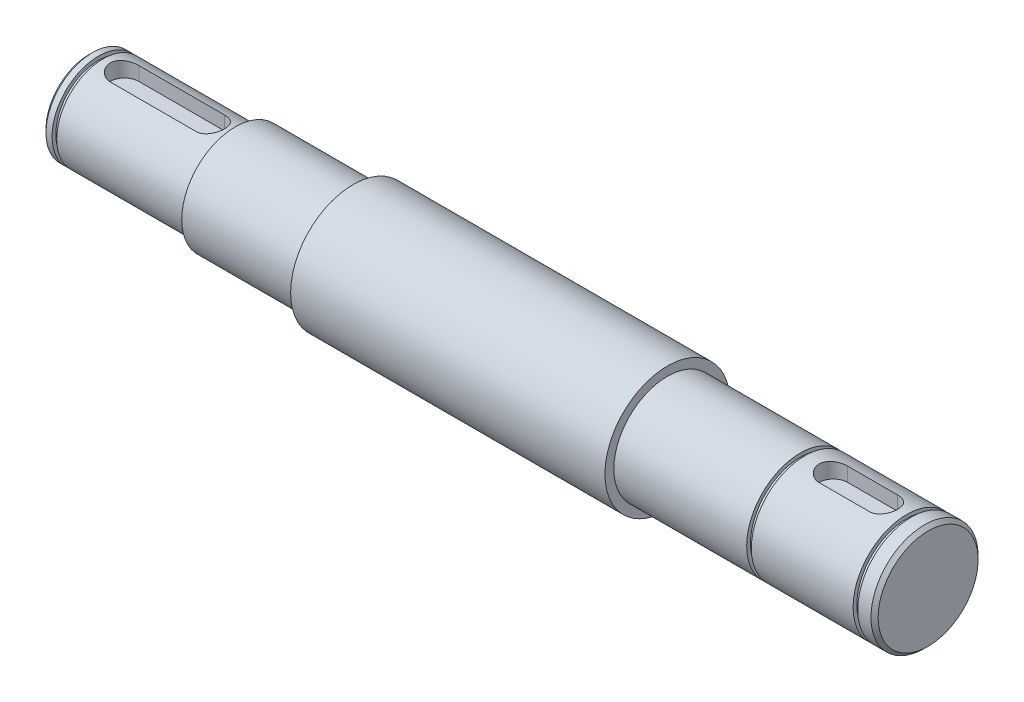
ISO-10303-21;
HEADER;
FILE_DESCRIPTION(('STEP AP214'),'2;1');
FILE_NAME('part.step','',(''),(''),'','','');
FILE_SCHEMA(('AUTOMOTIVE_DESIGN { 1 0 10303 214 1 1 1 1 }'));
ENDSEC;
DATA;
#1=APPLICATION_CONTEXT('core data for automotive mechanical design processes');
#2=APPLICATION_PROTOCOL_DEFINITION('international standard','automotive_design',2000,#1);
#3=PRODUCT_CONTEXT('',#1,'mechanical');
#4=PRODUCT('Part','Part','',(#3));
#5=PRODUCT_RELATED_PRODUCT_CATEGORY('part','',(#4));
#6=PRODUCT_DEFINITION_FORMATION('','',#4);
#7=PRODUCT_DEFINITION_CONTEXT('part definition',#1,'design');
#8=PRODUCT_DEFINITION('design','',#6,#7);
#9=PRODUCT_DEFINITION_SHAPE('','',#8);
#10=(LENGTH_UNIT() NAMED_UNIT(*) SI_UNIT(.MILLI.,.METRE.));
#11=(NAMED_UNIT(*) PLANE_ANGLE_UNIT() SI_UNIT($,.RADIAN.));
#12=(NAMED_UNIT(*) SI_UNIT($,.STERADIAN.) SOLID_ANGLE_UNIT());
#13=UNCERTAINTY_MEASURE_WITH_UNIT(LENGTH_MEASURE(1.E-05),#10,'distance_accuracy_value','');
#14=(GEOMETRIC_REPRESENTATION_CONTEXT(3) GLOBAL_UNCERTAINTY_ASSIGNED_CONTEXT((#13)) GLOBAL_UNIT_ASSIGNED_CONTEXT((#10,
#11,#12)) REPRESENTATION_CONTEXT('',''));
#15=CARTESIAN_POINT('',(0.,0.,0.));
#16=DIRECTION('',(0.,0.,1.));
#17=DIRECTION('',(1.,0.,0.));
#18=AXIS2_PLACEMENT_3D('',#15,#16,#17);
#19=CARTESIAN_POINT('',(0.,0.,0.));
#20=DIRECTION('',(1.,0.,0.));
#21=DIRECTION('',(0.,0.,-1.));
#22=AXIS2_PLACEMENT_3D('',#19,#20,#21);
#23=PLANE('',#22);
#24=CARTESIAN_POINT('',(0.,0.,0.));
#25=DIRECTION('',(1.,0.,0.));
#26=DIRECTION('',(0.,0.,-1.));
#27=AXIS2_PLACEMENT_3D('',#24,#25,#26);
#28=CIRCLE('',#27,12.);
#29=CARTESIAN_POINT('',(0.,0.,-12.));
#30=VERTEX_POINT('',#29);
#31=EDGE_CURVE('E317',#30,#30,#28,.F.);
#32=ORIENTED_EDGE('',*,*,#31,.T.);
#33=EDGE_LOOP('',(#32));
#34=FACE_BOUND('',#33,.T.);
#35=ADVANCED_FACE('F34',(#34),#23,.F.);
#36=CARTESIAN_POINT('',(0.,0.,0.));
#37=DIRECTION('',(-1.,0.,0.));
#38=DIRECTION('',(0.,0.,1.));
#39=AXIS2_PLACEMENT_3D('',#36,#37,#38);
#40=CYLINDRICAL_SURFACE('',#39,13.);
#41=CARTESIAN_POINT('',(1.00000000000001,0.,0.));
#42=DIRECTION('',(1.,0.,0.));
#43=DIRECTION('',(0.,0.,-1.));
#44=AXIS2_PLACEMENT_3D('',#41,#42,#43);
#45=CIRCLE('',#44,13.);
#46=CARTESIAN_POINT('',(1.00000000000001,0.,-13.));
#47=VERTEX_POINT('',#46);
#48=EDGE_CURVE('E315',#47,#47,#45,.T.);
#49=ORIENTED_EDGE('',*,*,#48,.T.);
#50=EDGE_LOOP('',(#49));
#51=FACE_BOUND('',#50,.T.);
#52=CARTESIAN_POINT('',(2.7,0.,0.));
#53=DIRECTION('',(-1.,0.,0.));
#54=DIRECTION('',(0.,0.,1.));
#55=AXIS2_PLACEMENT_3D('',#52,#53,#54);
#56=CIRCLE('',#55,13.);
#57=CARTESIAN_POINT('',(2.7,0.,13.));
#58=VERTEX_POINT('',#57);
#59=EDGE_CURVE('E204',#58,#58,#56,.T.);
#60=ORIENTED_EDGE('',*,*,#59,.T.);
#61=EDGE_LOOP('',(#60));
#62=FACE_BOUND('',#61,.T.);
#63=ADVANCED_FACE('F292',(#51,#62),#40,.T.);
#64=CARTESIAN_POINT('',(2.7,11.95,0.));
#65=DIRECTION('',(-1.,0.,0.));
#66=DIRECTION('',(0.,0.,1.));
#67=AXIS2_PLACEMENT_3D('',#64,#65,#66);
#68=PLANE('',#67);
#69=ORIENTED_EDGE('',*,*,#59,.F.);
#70=EDGE_LOOP('',(#69));
#71=FACE_BOUND('',#70,.T.);
#72=CARTESIAN_POINT('',(2.7,0.,0.));
#73=DIRECTION('',(-1.,0.,0.));
#74=DIRECTION('',(0.,0.,1.));
#75=AXIS2_PLACEMENT_3D('',#72,#73,#74);
#76=CIRCLE('',#75,11.95);
#77=CARTESIAN_POINT('',(2.7,0.,11.95));
#78=VERTEX_POINT('',#77);
#79=EDGE_CURVE('E201',#78,#78,#76,.T.);
#80=ORIENTED_EDGE('',*,*,#79,.T.);
#81=EDGE_LOOP('',(#80));
#82=FACE_BOUND('',#81,.T.);
#83=ADVANCED_FACE('F298',(#71,#82),#68,.F.);
#84=CARTESIAN_POINT('',(0.,0.,0.));
#85=DIRECTION('',(-1.,0.,0.));
#86=DIRECTION('',(0.,0.,1.));
#87=AXIS2_PLACEMENT_3D('',#84,#85,#86);
#88=CYLINDRICAL_SURFACE('',#87,11.95);
#89=ORIENTED_EDGE('',*,*,#79,.F.);
#90=EDGE_LOOP('',(#89));
#91=FACE_BOUND('',#90,.T.);
#92=CARTESIAN_POINT('',(4.,0.,0.));
#93=DIRECTION('',(-1.,0.,0.));
#94=DIRECTION('',(0.,0.,1.));
#95=AXIS2_PLACEMENT_3D('',#92,#93,#94);
#96=CIRCLE('',#95,11.95);
#97=CARTESIAN_POINT('',(4.,0.,11.95));
#98=VERTEX_POINT('',#97);
#99=EDGE_CURVE('E198',#98,#98,#96,.T.);
#100=ORIENTED_EDGE('',*,*,#99,.T.);
#101=EDGE_LOOP('',(#100));
#102=FACE_BOUND('',#101,.T.);
#103=ADVANCED_FACE('F572',(#91,#102),#88,.T.);
#104=CARTESIAN_POINT('',(4.,11.95,0.));
#105=DIRECTION('',(1.,0.,0.));
#106=DIRECTION('',(0.,0.,-1.));
#107=AXIS2_PLACEMENT_3D('',#104,#105,#106);
#108=PLANE('',#107);
#109=ORIENTED_EDGE('',*,*,#99,.F.);
#110=EDGE_LOOP('',(#109));
#111=FACE_BOUND('',#110,.T.);
#112=CARTESIAN_POINT('',(4.,0.,0.));
#113=DIRECTION('',(-1.,0.,0.));
#114=DIRECTION('',(0.,0.,1.));
#115=AXIS2_PLACEMENT_3D('',#112,#113,#114);
#116=CIRCLE('',#115,13.);
#117=CARTESIAN_POINT('',(4.,0.,13.));
#118=VERTEX_POINT('',#117);
#119=EDGE_CURVE('E195',#118,#118,#116,.T.);
#120=ORIENTED_EDGE('',*,*,#119,.T.);
#121=EDGE_LOOP('',(#120));
#122=FACE_BOUND('',#121,.T.);
#123=ADVANCED_FACE('F456',(#111,#122),#108,.F.);
#124=CARTESIAN_POINT('',(0.,0.,0.));
#125=DIRECTION('',(-1.,0.,0.));
#126=DIRECTION('',(0.,0.,1.));
#127=AXIS2_PLACEMENT_3D('',#124,#125,#126);
#128=CYLINDRICAL_SURFACE('',#127,13.);
#129=DIRECTION('',(-1.,0.,0.));
#130=VECTOR('',#129,1.);
#131=CARTESIAN_POINT('',(0.,12.369316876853,-4.));
#132=LINE('',#131,#130);
#133=CARTESIAN_POINT('',(10.,12.369316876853,-4.));
#134=VERTEX_POINT('',#133);
#135=CARTESIAN_POINT('',(34.,12.369316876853,-4.));
#136=VERTEX_POINT('',#135);
#137=EDGE_CURVE('E601',#134,#136,#132,.F.);
#138=ORIENTED_EDGE('',*,*,#137,.T.);
#139=CARTESIAN_POINT('',(34.,12.369316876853,-4.));
#140=CARTESIAN_POINT('',(34.1096372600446,12.3693011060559,-4.00001385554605));
#141=CARTESIAN_POINT('',(34.2192655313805,12.3707741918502,-3.99549264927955));
#142=CARTESIAN_POINT('',(34.437682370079,12.3765808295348,-3.97748793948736));
#143=CARTESIAN_POINT('',(34.5464711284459,12.3809137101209,-3.96400653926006));
#144=CARTESIAN_POINT('',(34.7621561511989,12.3923078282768,-3.9282361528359));
#145=CARTESIAN_POINT('',(34.8690566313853,12.399361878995,-3.90597036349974));
#146=CARTESIAN_POINT('',(35.0804758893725,12.4159696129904,-3.85285190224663));
#147=CARTESIAN_POINT('',(35.1849945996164,12.4255233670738,-3.82199898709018));
#148=CARTESIAN_POINT('',(35.4938136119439,12.4575175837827,-3.71694513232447));
#149=CARTESIAN_POINT('',(35.6936609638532,12.483307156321,-3.63020142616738));
#150=CARTESIAN_POINT('',(36.0759730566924,12.5408839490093,-3.42599155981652));
#151=CARTESIAN_POINT('',(36.2584290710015,12.572674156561,-3.30851008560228));
#152=CARTESIAN_POINT('',(36.6068944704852,12.639849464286,-3.04197546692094));
#153=CARTESIAN_POINT('',(36.7722464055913,12.6753137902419,-2.89208104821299));
#154=CARTESIAN_POINT('',(37.0759050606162,12.7451676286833,-2.56677638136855));
#155=CARTESIAN_POINT('',(37.214207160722,12.7795569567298,-2.39136178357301));
#156=CARTESIAN_POINT('',(37.4627491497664,12.8442939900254,-2.01525564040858));
#157=CARTESIAN_POINT('',(37.5723094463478,12.8745369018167,-1.81409533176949));
#158=CARTESIAN_POINT('',(37.7557811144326,12.9266435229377,-1.39512400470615));
#159=CARTESIAN_POINT('',(37.8297020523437,12.9485094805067,-1.17731747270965));
#160=CARTESIAN_POINT('',(37.9376008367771,12.980836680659,-0.738159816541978));
#161=CARTESIAN_POINT('',(37.9727098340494,12.9916202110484,-0.51711076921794));
#162=CARTESIAN_POINT('',(38.0055692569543,13.0017046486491,-0.0720095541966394));
#163=CARTESIAN_POINT('',(38.0033271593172,13.0010078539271,0.152042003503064));
#164=CARTESIAN_POINT('',(37.9622968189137,12.9884354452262,0.588828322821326));
#165=CARTESIAN_POINT('',(37.9247349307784,12.976934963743,0.801690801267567));
#166=CARTESIAN_POINT('',(37.8161398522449,12.9445067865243,1.2179273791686));
#167=CARTESIAN_POINT('',(37.7451048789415,12.923578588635,1.42130097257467));
#168=CARTESIAN_POINT('',(37.5707776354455,12.8741371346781,1.81565284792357));
#169=CARTESIAN_POINT('',(37.467107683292,12.8455356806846,2.00645263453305));
#170=CARTESIAN_POINT('',(37.2307457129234,12.7837686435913,2.36833420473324));
#171=CARTESIAN_POINT('',(37.0980468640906,12.7506019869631,2.53941133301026));
#172=CARTESIAN_POINT('',(36.8011250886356,12.6816648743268,2.86427703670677));
#173=CARTESIAN_POINT('',(36.6358457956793,12.6458433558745,3.0170888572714));
#174=CARTESIAN_POINT('',(36.2815126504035,12.5767737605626,3.29318735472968));
#175=CARTESIAN_POINT('',(36.0924517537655,12.5435264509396,3.41646525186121));
#176=CARTESIAN_POINT('',(35.7938396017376,12.4983185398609,3.57703281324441));
#177=CARTESIAN_POINT('',(35.6911363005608,12.4839545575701,3.62672040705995));
#178=CARTESIAN_POINT('',(35.4816454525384,12.4573073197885,3.71721967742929));
#179=CARTESIAN_POINT('',(35.3748596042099,12.4450232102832,3.75803499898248));
#180=CARTESIAN_POINT('',(35.1580745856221,12.4229432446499,3.83039332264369));
#181=CARTESIAN_POINT('',(35.0480789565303,12.413144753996,3.86194614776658));
#182=CARTESIAN_POINT('',(34.8256286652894,12.3963449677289,3.91553543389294));
#183=CARTESIAN_POINT('',(34.71317515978,12.3893423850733,3.93757627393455));
#184=CARTESIAN_POINT('',(34.5006880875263,12.3790500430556,3.96980876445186));
#185=CARTESIAN_POINT('',(34.4008413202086,12.3754078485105,3.98112989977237));
#186=CARTESIAN_POINT('',(34.2006656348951,12.3705374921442,3.9962248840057));
#187=CARTESIAN_POINT('',(34.1003376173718,12.3693058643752,4.00000956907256));
#188=CARTESIAN_POINT('',(34.,12.369316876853,4.));
#189=B_SPLINE_CURVE_WITH_KNOTS('',3,(#139,#140,#141,#142,#143,#144,#145,#146,#147,#148,#149,
#150,#151,#152,#153,#154,#155,#156,#157,#158,#159,#160,#161,#162,#163,#164,#165,#166,#167,#168,
#169,#170,#171,#172,#173,#174,#175,#176,#177,#178,#179,#180,#181,#182,#183,#184,#185,#186,#187,
#188),.UNSPECIFIED.,.F.,.F.,(4,2,2,2,2,2,2,2,2,2,2,2,2,2,2,2,2,2,2,2,2,2,2,2,4),(0.,
0.328793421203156,0.657509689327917,0.985363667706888,1.31322693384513,1.96809857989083,
2.62329711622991,3.2981478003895,3.97311364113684,4.66283549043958,5.35237209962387,
6.02123451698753,6.68996304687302,7.33629750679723,7.98266639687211,8.63680913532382,
9.29110596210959,9.97181686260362,10.6527298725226,10.9973477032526,11.3418236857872,
11.6859330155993,12.0298837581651,12.3312338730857,12.6321503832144),.UNSPECIFIED.);
#190=CARTESIAN_POINT('',(34.,12.369316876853,4.));
#191=VERTEX_POINT('',#190);
#192=EDGE_CURVE('E207',#136,#191,#189,.T.);
#193=ORIENTED_EDGE('',*,*,#192,.T.);
#194=DIRECTION('',(-1.,0.,0.));
#195=VECTOR('',#194,1.);
#196=CARTESIAN_POINT('',(0.,12.369316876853,4.));
#197=LINE('',#196,#195);
#198=CARTESIAN_POINT('',(10.,12.369316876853,4.));
#199=VERTEX_POINT('',#198);
#200=EDGE_CURVE('E603',#191,#199,#197,.T.);
#201=ORIENTED_EDGE('',*,*,#200,.T.);
#202=CARTESIAN_POINT('',(10.,12.369316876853,4.));
#203=CARTESIAN_POINT('',(9.89036273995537,12.3693011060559,4.00001385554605));
#204=CARTESIAN_POINT('',(9.78073446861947,12.3707741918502,3.99549264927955));
#205=CARTESIAN_POINT('',(9.56231762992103,12.3765808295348,3.97748793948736));
#206=CARTESIAN_POINT('',(9.45352887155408,12.3809137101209,3.96400653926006));
#207=CARTESIAN_POINT('',(9.23784384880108,12.3923078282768,3.9282361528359));
#208=CARTESIAN_POINT('',(9.13094336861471,12.399361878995,3.90597036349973));
#209=CARTESIAN_POINT('',(8.91952411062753,12.4159696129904,3.85285190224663));
#210=CARTESIAN_POINT('',(8.81500540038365,12.4255233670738,3.82199898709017));
#211=CARTESIAN_POINT('',(8.50618638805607,12.4575175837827,3.71694513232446));
#212=CARTESIAN_POINT('',(8.30633903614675,12.483307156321,3.63020142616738));
#213=CARTESIAN_POINT('',(7.92402694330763,12.5408839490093,3.42599155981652));
#214=CARTESIAN_POINT('',(7.74157092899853,12.572674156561,3.30851008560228));
#215=CARTESIAN_POINT('',(7.39310552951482,12.639849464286,3.04197546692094));
#216=CARTESIAN_POINT('',(7.22775359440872,12.6753137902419,2.892081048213));
#217=CARTESIAN_POINT('',(6.92409493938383,12.7451676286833,2.56677638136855));
#218=CARTESIAN_POINT('',(6.78579283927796,12.7795569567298,2.39136178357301));
#219=CARTESIAN_POINT('',(6.53725085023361,12.8442939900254,2.01525564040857));
#220=CARTESIAN_POINT('',(6.42769055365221,12.8745369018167,1.81409533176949));
#221=CARTESIAN_POINT('',(6.24421888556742,12.9266435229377,1.39512400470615));
#222=CARTESIAN_POINT('',(6.1702979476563,12.9485094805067,1.17731747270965));
#223=CARTESIAN_POINT('',(6.06239916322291,12.980836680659,0.738159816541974));
#224=CARTESIAN_POINT('',(6.02729016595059,12.9916202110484,0.517110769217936));
#225=CARTESIAN_POINT('',(5.99443074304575,13.0017046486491,0.0720095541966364));
#226=CARTESIAN_POINT('',(5.99667284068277,13.0010078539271,-0.152042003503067));
#227=CARTESIAN_POINT('',(6.0377031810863,12.9884354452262,-0.588828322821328));
#228=CARTESIAN_POINT('',(6.07526506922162,12.976934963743,-0.801690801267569));
#229=CARTESIAN_POINT('',(6.18386014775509,12.9445067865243,-1.2179273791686));
#230=CARTESIAN_POINT('',(6.25489512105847,12.923578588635,-1.42130097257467));
#231=CARTESIAN_POINT('',(6.42922236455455,12.8741371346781,-1.81565284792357));
#232=CARTESIAN_POINT('',(6.53289231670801,12.8455356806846,-2.00645263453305));
#233=CARTESIAN_POINT('',(6.76925428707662,12.7837686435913,-2.36833420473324));
#234=CARTESIAN_POINT('',(6.90195313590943,12.7506019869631,-2.53941133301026));
#235=CARTESIAN_POINT('',(7.1988749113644,12.6816648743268,-2.86427703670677));
#236=CARTESIAN_POINT('',(7.36415420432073,12.6458433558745,-3.0170888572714));
#237=CARTESIAN_POINT('',(7.71848734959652,12.5767737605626,-3.29318735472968));
#238=CARTESIAN_POINT('',(7.90754824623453,12.5435264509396,-3.41646525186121));
#239=CARTESIAN_POINT('',(8.20616039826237,12.4983185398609,-3.57703281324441));
#240=CARTESIAN_POINT('',(8.30886369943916,12.48395455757,-3.62672040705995));
#241=CARTESIAN_POINT('',(8.51835454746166,12.4573073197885,-3.7172196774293));
#242=CARTESIAN_POINT('',(8.62514039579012,12.4450232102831,-3.75803499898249));
#243=CARTESIAN_POINT('',(8.84192541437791,12.4229432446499,-3.83039332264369));
#244=CARTESIAN_POINT('',(8.95192104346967,12.413144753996,-3.86194614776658));
#245=CARTESIAN_POINT('',(9.17437133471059,12.3963449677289,-3.91553543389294));
#246=CARTESIAN_POINT('',(9.28682484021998,12.3893423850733,-3.93757627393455));
#247=CARTESIAN_POINT('',(9.4993119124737,12.3790500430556,-3.96980876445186));
#248=CARTESIAN_POINT('',(9.59915867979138,12.3754078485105,-3.98112989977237));
#249=CARTESIAN_POINT('',(9.7993343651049,12.3705374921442,-3.9962248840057));
#250=CARTESIAN_POINT('',(9.89966238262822,12.3693058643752,-4.00000956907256));
#251=CARTESIAN_POINT('',(10.,12.369316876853,-4.));
#252=B_SPLINE_CURVE_WITH_KNOTS('',3,(#202,#203,#204,#205,#206,#207,#208,#209,#210,#211,#212,
#213,#214,#215,#216,#217,#218,#219,#220,#221,#222,#223,#224,#225,#226,#227,#228,#229,#230,#231,
#232,#233,#234,#235,#236,#237,#238,#239,#240,#241,#242,#243,#244,#245,#246,#247,#248,#249,#250,
#251),.UNSPECIFIED.,.F.,.F.,(4,2,2,2,2,2,2,2,2,2,2,2,2,2,2,2,2,2,2,2,2,2,2,2,4),(0.,
0.328793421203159,0.657509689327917,0.985363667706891,1.31322693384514,1.96809857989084,
2.62329711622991,3.2981478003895,3.97311364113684,4.66283549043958,5.35237209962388,
6.02123451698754,6.68996304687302,7.33629750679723,7.98266639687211,8.63680913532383,
9.29110596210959,9.97181686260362,10.6527298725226,10.9973477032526,11.3418236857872,
11.6859330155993,12.0298837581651,12.3312338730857,12.6321503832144),.UNSPECIFIED.);
#253=EDGE_CURVE('E57',#199,#134,#252,.T.);
#254=ORIENTED_EDGE('',*,*,#253,.T.);
#255=EDGE_LOOP('',(#138,#193,#201,#254));
#256=FACE_BOUND('',#255,.T.);
#257=ORIENTED_EDGE('',*,*,#119,.F.);
#258=EDGE_LOOP('',(#257));
#259=FACE_BOUND('',#258,.T.);
#260=CARTESIAN_POINT('',(41.,0.,0.));
#261=DIRECTION('',(-1.,0.,0.));
#262=DIRECTION('',(0.,0.,1.));
#263=AXIS2_PLACEMENT_3D('',#260,#261,#262);
#264=CIRCLE('',#263,13.);
#265=CARTESIAN_POINT('',(41.,0.,13.));
#266=VERTEX_POINT('',#265);
#267=EDGE_CURVE('E192',#266,#266,#264,.T.);
#268=ORIENTED_EDGE('',*,*,#267,.T.);
#269=EDGE_LOOP('',(#268));
#270=FACE_BOUND('',#269,.T.);
#271=ADVANCED_FACE('F220',(#256,#259,#270),#128,.T.);
#272=CARTESIAN_POINT('',(41.,13.,0.));
#273=DIRECTION('',(1.,0.,0.));
#274=DIRECTION('',(0.,0.,-1.));
#275=AXIS2_PLACEMENT_3D('',#272,#273,#274);
#276=PLANE('',#275);
#277=ORIENTED_EDGE('',*,*,#267,.F.);
#278=EDGE_LOOP('',(#277));
#279=FACE_BOUND('',#278,.T.);
#280=CARTESIAN_POINT('',(41.,0.,0.));
#281=DIRECTION('',(-1.,0.,0.));
#282=DIRECTION('',(0.,0.,1.));
#283=AXIS2_PLACEMENT_3D('',#280,#281,#282);
#284=CIRCLE('',#283,15.);
#285=CARTESIAN_POINT('',(41.,0.,15.));
#286=VERTEX_POINT('',#285);
#287=EDGE_CURVE('E189',#286,#286,#284,.T.);
#288=ORIENTED_EDGE('',*,*,#287,.T.);
#289=EDGE_LOOP('',(#288));
#290=FACE_BOUND('',#289,.T.);
#291=ADVANCED_FACE('F455',(#279,#290),#276,.F.);
#292=CARTESIAN_POINT('',(0.,0.,0.));
#293=DIRECTION('',(-1.,0.,0.));
#294=DIRECTION('',(0.,0.,1.));
#295=AXIS2_PLACEMENT_3D('',#292,#293,#294);
#296=CYLINDRICAL_SURFACE('',#295,15.);
#297=ORIENTED_EDGE('',*,*,#287,.F.);
#298=EDGE_LOOP('',(#297));
#299=FACE_BOUND('',#298,.T.);
#300=CARTESIAN_POINT('',(74.,0.,0.));
#301=DIRECTION('',(-1.,0.,0.));
#302=DIRECTION('',(0.,0.,1.));
#303=AXIS2_PLACEMENT_3D('',#300,#301,#302);
#304=CIRCLE('',#303,15.);
#305=CARTESIAN_POINT('',(74.,0.,15.));
#306=VERTEX_POINT('',#305);
#307=EDGE_CURVE('E186',#306,#306,#304,.T.);
#308=ORIENTED_EDGE('',*,*,#307,.T.);
#309=EDGE_LOOP('',(#308));
#310=FACE_BOUND('',#309,.T.);
#311=ADVANCED_FACE('F471',(#299,#310),#296,.T.);
#312=CARTESIAN_POINT('',(74.,15.,0.));
#313=DIRECTION('',(1.,0.,0.));
#314=DIRECTION('',(0.,0.,-1.));
#315=AXIS2_PLACEMENT_3D('',#312,#313,#314);
#316=PLANE('',#315);
#317=ORIENTED_EDGE('',*,*,#307,.F.);
#318=EDGE_LOOP('',(#317));
#319=FACE_BOUND('',#318,.T.);
#320=CARTESIAN_POINT('',(74.,0.,0.));
#321=DIRECTION('',(-1.,0.,0.));
#322=DIRECTION('',(0.,0.,1.));
#323=AXIS2_PLACEMENT_3D('',#320,#321,#322);
#324=CIRCLE('',#323,17.5);
#325=CARTESIAN_POINT('',(74.,0.,17.5));
#326=VERTEX_POINT('',#325);
#327=EDGE_CURVE('E183',#326,#326,#324,.T.);
#328=ORIENTED_EDGE('',*,*,#327,.T.);
#329=EDGE_LOOP('',(#328));
#330=FACE_BOUND('',#329,.T.);
#331=ADVANCED_FACE('F477',(#319,#330),#316,.F.);
#332=CARTESIAN_POINT('',(0.,0.,0.));
#333=DIRECTION('',(-1.,0.,0.));
#334=DIRECTION('',(0.,0.,1.));
#335=AXIS2_PLACEMENT_3D('',#332,#333,#334);
#336=CYLINDRICAL_SURFACE('',#335,17.5);
#337=ORIENTED_EDGE('',*,*,#327,.F.);
#338=EDGE_LOOP('',(#337));
#339=FACE_BOUND('',#338,.T.);
#340=CARTESIAN_POINT('',(162.,0.,0.));
#341=DIRECTION('',(-1.,0.,0.));
#342=DIRECTION('',(0.,0.,1.));
#343=AXIS2_PLACEMENT_3D('',#340,#341,#342);
#344=CIRCLE('',#343,17.5);
#345=CARTESIAN_POINT('',(162.,0.,17.5));
#346=VERTEX_POINT('',#345);
#347=EDGE_CURVE('E180',#346,#346,#344,.T.);
#348=ORIENTED_EDGE('',*,*,#347,.T.);
#349=EDGE_LOOP('',(#348));
#350=FACE_BOUND('',#349,.T.);
#351=ADVANCED_FACE('F485',(#339,#350),#336,.T.);
#352=CARTESIAN_POINT('',(162.,17.5,0.));
#353=DIRECTION('',(-1.,0.,0.));
#354=DIRECTION('',(0.,0.,1.));
#355=AXIS2_PLACEMENT_3D('',#352,#353,#354);
#356=PLANE('',#355);
#357=ORIENTED_EDGE('',*,*,#347,.F.);
#358=EDGE_LOOP('',(#357));
#359=FACE_BOUND('',#358,.T.);
#360=CARTESIAN_POINT('',(162.,0.,0.));
#361=DIRECTION('',(-1.,0.,0.));
#362=DIRECTION('',(0.,0.,1.));
#363=AXIS2_PLACEMENT_3D('',#360,#361,#362);
#364=CIRCLE('',#363,15.);
#365=CARTESIAN_POINT('',(162.,0.,15.));
#366=VERTEX_POINT('',#365);
#367=EDGE_CURVE('E177',#366,#366,#364,.T.);
#368=ORIENTED_EDGE('',*,*,#367,.T.);
#369=EDGE_LOOP('',(#368));
#370=FACE_BOUND('',#369,.T.);
#371=ADVANCED_FACE('F493',(#359,#370),#356,.F.);
#372=CARTESIAN_POINT('',(0.,0.,0.));
#373=DIRECTION('',(-1.,0.,0.));
#374=DIRECTION('',(0.,0.,1.));
#375=AXIS2_PLACEMENT_3D('',#372,#373,#374);
#376=CYLINDRICAL_SURFACE('',#375,15.);
#377=ORIENTED_EDGE('',*,*,#367,.F.);
#378=EDGE_LOOP('',(#377));
#379=FACE_BOUND('',#378,.T.);
#380=CARTESIAN_POINT('',(199.2,0.,0.));
#381=DIRECTION('',(-1.,0.,0.));
#382=DIRECTION('',(0.,0.,1.));
#383=AXIS2_PLACEMENT_3D('',#380,#381,#382);
#384=CIRCLE('',#383,15.);
#385=CARTESIAN_POINT('',(199.2,0.,15.));
#386=VERTEX_POINT('',#385);
#387=EDGE_CURVE('E174',#386,#386,#384,.T.);
#388=ORIENTED_EDGE('',*,*,#387,.T.);
#389=EDGE_LOOP('',(#388));
#390=FACE_BOUND('',#389,.T.);
#391=ADVANCED_FACE('F501',(#379,#390),#376,.T.);
#392=CARTESIAN_POINT('',(199.2,15.,0.));
#393=DIRECTION('',(-1.,0.,0.));
#394=DIRECTION('',(0.,0.,1.));
#395=AXIS2_PLACEMENT_3D('',#392,#393,#394);
#396=PLANE('',#395);
#397=ORIENTED_EDGE('',*,*,#387,.F.);
#398=EDGE_LOOP('',(#397));
#399=FACE_BOUND('',#398,.T.);
#400=CARTESIAN_POINT('',(199.2,0.,0.));
#401=DIRECTION('',(-1.,0.,0.));
#402=DIRECTION('',(0.,0.,1.));
#403=AXIS2_PLACEMENT_3D('',#400,#401,#402);
#404=CIRCLE('',#403,13.95);
#405=CARTESIAN_POINT('',(199.2,0.,13.95));
#406=VERTEX_POINT('',#405);
#407=EDGE_CURVE('E171',#406,#406,#404,.T.);
#408=ORIENTED_EDGE('',*,*,#407,.T.);
#409=EDGE_LOOP('',(#408));
#410=FACE_BOUND('',#409,.T.);
#411=ADVANCED_FACE('F509',(#399,#410),#396,.F.);
#412=CARTESIAN_POINT('',(0.,0.,0.));
#413=DIRECTION('',(-1.,0.,0.));
#414=DIRECTION('',(0.,0.,1.));
#415=AXIS2_PLACEMENT_3D('',#412,#413,#414);
#416=CYLINDRICAL_SURFACE('',#415,13.95);
#417=ORIENTED_EDGE('',*,*,#407,.F.);
#418=EDGE_LOOP('',(#417));
#419=FACE_BOUND('',#418,.T.);
#420=CARTESIAN_POINT('',(200.5,0.,0.));
#421=DIRECTION('',(-1.,0.,0.));
#422=DIRECTION('',(0.,0.,1.));
#423=AXIS2_PLACEMENT_3D('',#420,#421,#422);
#424=CIRCLE('',#423,13.95);
#425=CARTESIAN_POINT('',(200.5,0.,13.95));
#426=VERTEX_POINT('',#425);
#427=EDGE_CURVE('E168',#426,#426,#424,.T.);
#428=ORIENTED_EDGE('',*,*,#427,.T.);
#429=EDGE_LOOP('',(#428));
#430=FACE_BOUND('',#429,.T.);
#431=ADVANCED_FACE('F516',(#419,#430),#416,.T.);
#432=CARTESIAN_POINT('',(200.5,13.95,0.));
#433=DIRECTION('',(1.,0.,0.));
#434=DIRECTION('',(0.,0.,-1.));
#435=AXIS2_PLACEMENT_3D('',#432,#433,#434);
#436=PLANE('',#435);
#437=ORIENTED_EDGE('',*,*,#427,.F.);
#438=EDGE_LOOP('',(#437));
#439=FACE_BOUND('',#438,.T.);
#440=CARTESIAN_POINT('',(200.5,0.,0.));
#441=DIRECTION('',(-1.,0.,0.));
#442=DIRECTION('',(0.,0.,1.));
#443=AXIS2_PLACEMENT_3D('',#440,#441,#442);
#444=CIRCLE('',#443,15.);
#445=CARTESIAN_POINT('',(200.5,0.,15.));
#446=VERTEX_POINT('',#445);
#447=EDGE_CURVE('E165',#446,#446,#444,.T.);
#448=ORIENTED_EDGE('',*,*,#447,.T.);
#449=EDGE_LOOP('',(#448));
#450=FACE_BOUND('',#449,.T.);
#451=ADVANCED_FACE('F264',(#439,#450),#436,.F.);
#452=CARTESIAN_POINT('',(0.,0.,0.));
#453=DIRECTION('',(-1.,0.,0.));
#454=DIRECTION('',(0.,0.,1.));
#455=AXIS2_PLACEMENT_3D('',#452,#453,#454);
#456=CYLINDRICAL_SURFACE('',#455,15.);
#457=DIRECTION('',(-1.,0.,0.));
#458=VECTOR('',#457,1.);
#459=CARTESIAN_POINT('',(0.,14.456832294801,-4.));
#460=LINE('',#459,#458);
#461=CARTESIAN_POINT('',(208.5,14.456832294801,-4.));
#462=VERTEX_POINT('',#461);
#463=CARTESIAN_POINT('',(222.5,14.456832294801,-4.));
#464=VERTEX_POINT('',#463);
#465=EDGE_CURVE('E318',#462,#464,#460,.F.);
#466=ORIENTED_EDGE('',*,*,#465,.T.);
#467=CARTESIAN_POINT('',(222.5,14.456832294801,-4.));
#468=CARTESIAN_POINT('',(222.610358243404,14.4568189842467,-4.00001309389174));
#469=CARTESIAN_POINT('',(222.720708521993,14.4580956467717,-3.99543311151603));
#470=CARTESIAN_POINT('',(222.940578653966,14.4631301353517,-3.97718874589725));
#471=CARTESIAN_POINT('',(223.05009865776,14.4668875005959,-3.96352604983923));
#472=CARTESIAN_POINT('',(223.267301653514,14.4767740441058,-3.92725695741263));
#473=CARTESIAN_POINT('',(223.374988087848,14.482898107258,-3.90466984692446));
#474=CARTESIAN_POINT('',(223.587974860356,14.4973231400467,-3.85076543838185));
#475=CARTESIAN_POINT('',(223.693275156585,14.5056241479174,-3.81944798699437));
#476=CARTESIAN_POINT('',(224.004463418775,14.5334412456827,-3.71275643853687));
#477=CARTESIAN_POINT('',(224.205874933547,14.5558829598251,-3.62460332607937));
#478=CARTESIAN_POINT('',(224.591020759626,14.6060171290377,-3.41695780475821));
#479=CARTESIAN_POINT('',(224.774749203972,14.6337113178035,-3.29745504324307));
#480=CARTESIAN_POINT('',(225.123970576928,14.6920016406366,-3.02730320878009));
#481=CARTESIAN_POINT('',(225.288961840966,14.7226489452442,-2.87601544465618));
#482=CARTESIAN_POINT('',(225.591557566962,14.7829523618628,-2.54795832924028));
#483=CARTESIAN_POINT('',(225.729157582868,14.8126083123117,-2.37118484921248));
#484=CARTESIAN_POINT('',(225.975172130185,14.8681604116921,-1.99367199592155));
#485=CARTESIAN_POINT('',(226.083083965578,14.8939887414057,-1.79259414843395));
#486=CARTESIAN_POINT('',(226.263372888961,14.9383834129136,-1.37435575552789));
#487=CARTESIAN_POINT('',(226.335757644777,14.9569513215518,-1.15719869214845));
#488=CARTESIAN_POINT('',(226.441309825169,14.9843709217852,-0.718234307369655));
#489=CARTESIAN_POINT('',(226.475337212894,14.9934353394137,-0.496647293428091));
#490=CARTESIAN_POINT('',(226.505914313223,15.0015705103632,-0.0507319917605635));
#491=CARTESIAN_POINT('',(226.502469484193,15.0006427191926,0.173595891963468));
#492=CARTESIAN_POINT('',(226.458804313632,14.9890534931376,0.612629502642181));
#493=CARTESIAN_POINT('',(226.419513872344,14.9786381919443,0.827435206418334));
#494=CARTESIAN_POINT('',(226.306774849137,14.9495347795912,1.24728467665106));
#495=CARTESIAN_POINT('',(226.233324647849,14.9308462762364,1.45232797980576));
#496=CARTESIAN_POINT('',(226.053640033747,14.8869312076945,1.84920963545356));
#497=CARTESIAN_POINT('',(225.94708662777,14.8616414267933,2.04089626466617));
#498=CARTESIAN_POINT('',(225.704457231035,14.8072486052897,2.40398441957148));
#499=CARTESIAN_POINT('',(225.568376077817,14.7781448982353,2.57538239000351));
#500=CARTESIAN_POINT('',(225.265672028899,14.7182294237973,2.89854935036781));
#501=CARTESIAN_POINT('',(225.098241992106,14.6873926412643,3.04955722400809));
#502=CARTESIAN_POINT('',(224.739957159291,14.6282716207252,3.32161448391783));
#503=CARTESIAN_POINT('',(224.549095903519,14.5999880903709,3.44265558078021));
#504=CARTESIAN_POINT('',(224.248646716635,14.5618587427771,3.59932937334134));
#505=CARTESIAN_POINT('',(224.145711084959,14.5498268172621,3.64754371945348));
#506=CARTESIAN_POINT('',(223.935953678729,14.5275984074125,3.73509417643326));
#507=CARTESIAN_POINT('',(223.829133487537,14.5174011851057,3.77443385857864));
#508=CARTESIAN_POINT('',(223.61248058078,14.4991713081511,3.84386783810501));
#509=CARTESIAN_POINT('',(223.502651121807,14.4911364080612,3.87397173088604));
#510=CARTESIAN_POINT('',(223.280724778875,14.4774747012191,3.92471856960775));
#511=CARTESIAN_POINT('',(223.16862897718,14.4718467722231,3.9453659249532));
#512=CARTESIAN_POINT('',(222.963748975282,14.4639761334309,3.97411378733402));
#513=CARTESIAN_POINT('',(222.871203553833,14.4613012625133,3.98382319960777));
#514=CARTESIAN_POINT('',(222.68577464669,14.4577275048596,3.99676420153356));
#515=CARTESIAN_POINT('',(222.592891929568,14.4568258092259,4.00000603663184));
#516=CARTESIAN_POINT('',(222.5,14.456832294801,4.));
#517=B_SPLINE_CURVE_WITH_KNOTS('',3,(#467,#468,#469,#470,#471,#472,#473,#474,#475,#476,#477,
#478,#479,#480,#481,#482,#483,#484,#485,#486,#487,#488,#489,#490,#491,#492,#493,#494,#495,#496,
#497,#498,#499,#500,#501,#502,#503,#504,#505,#506,#507,#508,#509,#510,#511,#512,#513,#514,#515,
#516),.UNSPECIFIED.,.F.,.F.,(4,2,2,2,2,2,2,2,2,2,2,2,2,2,2,2,2,2,2,2,2,2,2,2,4),(0.,
0.330958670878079,0.661855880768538,0.992041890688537,1.32223370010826,1.98190700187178,
2.64179842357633,3.31649637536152,3.9913037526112,4.67691814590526,5.36238449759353,
6.03215661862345,6.70183117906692,7.35461236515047,8.00742449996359,8.66673340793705,
9.32615767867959,10.005759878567,10.6855498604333,11.0281077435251,11.3705275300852,
11.7125903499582,12.0544935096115,12.3335333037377,12.6121307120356),.UNSPECIFIED.);
#518=CARTESIAN_POINT('',(222.5,14.456832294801,4.));
#519=VERTEX_POINT('',#518);
#520=EDGE_CURVE('E269',#464,#519,#517,.T.);
#521=ORIENTED_EDGE('',*,*,#520,.T.);
#522=DIRECTION('',(-1.,0.,0.));
#523=VECTOR('',#522,1.);
#524=CARTESIAN_POINT('',(0.,14.456832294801,4.));
#525=LINE('',#524,#523);
#526=CARTESIAN_POINT('',(208.5,14.456832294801,4.));
#527=VERTEX_POINT('',#526);
#528=EDGE_CURVE('E281',#519,#527,#525,.T.);
#529=ORIENTED_EDGE('',*,*,#528,.T.);
#530=CARTESIAN_POINT('',(208.5,14.456832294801,4.));
#531=CARTESIAN_POINT('',(208.389641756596,14.4568189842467,4.00001309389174));
#532=CARTESIAN_POINT('',(208.279291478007,14.4580956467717,3.99543311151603));
#533=CARTESIAN_POINT('',(208.059421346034,14.4631301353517,3.97718874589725));
#534=CARTESIAN_POINT('',(207.94990134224,14.4668875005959,3.96352604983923));
#535=CARTESIAN_POINT('',(207.732698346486,14.4767740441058,3.92725695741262));
#536=CARTESIAN_POINT('',(207.625011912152,14.482898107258,3.90466984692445));
#537=CARTESIAN_POINT('',(207.412025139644,14.4973231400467,3.85076543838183));
#538=CARTESIAN_POINT('',(207.306724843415,14.5056241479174,3.81944798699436));
#539=CARTESIAN_POINT('',(206.995536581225,14.5334412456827,3.71275643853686));
#540=CARTESIAN_POINT('',(206.794125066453,14.5558829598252,3.62460332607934));
#541=CARTESIAN_POINT('',(206.408979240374,14.6060171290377,3.41695780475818));
#542=CARTESIAN_POINT('',(206.225250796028,14.6337113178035,3.29745504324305));
#543=CARTESIAN_POINT('',(205.876029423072,14.6920016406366,3.02730320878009));
#544=CARTESIAN_POINT('',(205.711038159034,14.7226489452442,2.87601544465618));
#545=CARTESIAN_POINT('',(205.408442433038,14.7829523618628,2.54795832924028));
#546=CARTESIAN_POINT('',(205.270842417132,14.8126083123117,2.37118484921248));
#547=CARTESIAN_POINT('',(205.024827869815,14.8681604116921,1.99367199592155));
#548=CARTESIAN_POINT('',(204.916916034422,14.8939887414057,1.79259414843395));
#549=CARTESIAN_POINT('',(204.736627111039,14.9383834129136,1.37435575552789));
#550=CARTESIAN_POINT('',(204.664242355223,14.9569513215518,1.15719869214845));
#551=CARTESIAN_POINT('',(204.558690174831,14.9843709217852,0.718234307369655));
#552=CARTESIAN_POINT('',(204.524662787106,14.9934353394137,0.496647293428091));
#553=CARTESIAN_POINT('',(204.494085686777,15.0015705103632,0.0507319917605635));
#554=CARTESIAN_POINT('',(204.497530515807,15.0006427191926,-0.173595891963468));
#555=CARTESIAN_POINT('',(204.541195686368,14.9890534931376,-0.612629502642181));
#556=CARTESIAN_POINT('',(204.580486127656,14.9786381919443,-0.827435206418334));
#557=CARTESIAN_POINT('',(204.693225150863,14.9495347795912,-1.24728467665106));
#558=CARTESIAN_POINT('',(204.766675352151,14.9308462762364,-1.45232797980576));
#559=CARTESIAN_POINT('',(204.946359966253,14.8869312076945,-1.84920963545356));
#560=CARTESIAN_POINT('',(205.05291337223,14.8616414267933,-2.04089626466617));
#561=CARTESIAN_POINT('',(205.295542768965,14.8072486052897,-2.40398441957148));
#562=CARTESIAN_POINT('',(205.431623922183,14.7781448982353,-2.57538239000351));
#563=CARTESIAN_POINT('',(205.734327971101,14.7182294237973,-2.89854935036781));
#564=CARTESIAN_POINT('',(205.901758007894,14.6873926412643,-3.04955722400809));
#565=CARTESIAN_POINT('',(206.260042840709,14.6282716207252,-3.32161448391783));
#566=CARTESIAN_POINT('',(206.450904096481,14.5999880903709,-3.44265558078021));
#567=CARTESIAN_POINT('',(206.751353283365,14.5618587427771,-3.59932937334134));
#568=CARTESIAN_POINT('',(206.854288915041,14.5498268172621,-3.64754371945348));
#569=CARTESIAN_POINT('',(207.064046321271,14.5275984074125,-3.73509417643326));
#570=CARTESIAN_POINT('',(207.170866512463,14.5174011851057,-3.77443385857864));
#571=CARTESIAN_POINT('',(207.38751941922,14.4991713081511,-3.84386783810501));
#572=CARTESIAN_POINT('',(207.497348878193,14.4911364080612,-3.87397173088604));
#573=CARTESIAN_POINT('',(207.719275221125,14.4774747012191,-3.92471856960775));
#574=CARTESIAN_POINT('',(207.83137102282,14.4718467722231,-3.9453659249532));
#575=CARTESIAN_POINT('',(208.036251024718,14.4639761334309,-3.97411378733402));
#576=CARTESIAN_POINT('',(208.128796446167,14.4613012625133,-3.98382319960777));
#577=CARTESIAN_POINT('',(208.31422535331,14.4577275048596,-3.99676420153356));
#578=CARTESIAN_POINT('',(208.407108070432,14.4568258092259,-4.00000603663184));
#579=CARTESIAN_POINT('',(208.5,14.456832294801,-4.));
#580=B_SPLINE_CURVE_WITH_KNOTS('',3,(#530,#531,#532,#533,#534,#535,#536,#537,#538,#539,#540,
#541,#542,#543,#544,#545,#546,#547,#548,#549,#550,#551,#552,#553,#554,#555,#556,#557,#558,#559,
#560,#561,#562,#563,#564,#565,#566,#567,#568,#569,#570,#571,#572,#573,#574,#575,#576,#577,#578,
#579),.UNSPECIFIED.,.F.,.F.,(4,2,2,2,2,2,2,2,2,2,2,2,2,2,2,2,2,2,2,2,2,2,2,2,4),(0.,
0.330958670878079,0.661855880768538,0.992041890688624,1.32223370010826,1.98190700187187,
2.64179842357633,3.31649637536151,3.9913037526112,4.67691814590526,5.36238449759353,
6.03215661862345,6.70183117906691,7.35461236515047,8.00742449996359,8.66673340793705,
9.32615767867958,10.005759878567,10.6855498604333,11.0281077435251,11.3705275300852,
11.7125903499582,12.0544935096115,12.3335333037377,12.6121307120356),.UNSPECIFIED.);
#581=EDGE_CURVE('E49',#527,#462,#580,.T.);
#582=ORIENTED_EDGE('',*,*,#581,.T.);
#583=EDGE_LOOP('',(#466,#521,#529,#582));
#584=FACE_BOUND('',#583,.T.);
#585=ORIENTED_EDGE('',*,*,#447,.F.);
#586=EDGE_LOOP('',(#585));
#587=FACE_BOUND('',#586,.T.);
#588=CARTESIAN_POINT('',(229.,0.,0.));
#589=DIRECTION('',(-1.,0.,0.));
#590=DIRECTION('',(0.,0.,1.));
#591=AXIS2_PLACEMENT_3D('',#588,#589,#590);
#592=CIRCLE('',#591,15.);
#593=CARTESIAN_POINT('',(229.,0.,15.));
#594=VERTEX_POINT('',#593);
#595=EDGE_CURVE('E162',#594,#594,#592,.T.);
#596=ORIENTED_EDGE('',*,*,#595,.T.);
#597=EDGE_LOOP('',(#596));
#598=FACE_BOUND('',#597,.T.);
#599=ADVANCED_FACE('F259',(#584,#587,#598),#456,.T.);
#600=CARTESIAN_POINT('',(229.,15.,0.));
#601=DIRECTION('',(-1.,0.,0.));
#602=DIRECTION('',(0.,0.,1.));
#603=AXIS2_PLACEMENT_3D('',#600,#601,#602);
#604=PLANE('',#603);
#605=ORIENTED_EDGE('',*,*,#595,.F.);
#606=EDGE_LOOP('',(#605));
#607=FACE_BOUND('',#606,.T.);
#608=CARTESIAN_POINT('',(229.,0.,0.));
#609=DIRECTION('',(-1.,0.,0.));
#610=DIRECTION('',(0.,0.,1.));
#611=AXIS2_PLACEMENT_3D('',#608,#609,#610);
#612=CIRCLE('',#611,13.95);
#613=CARTESIAN_POINT('',(229.,0.,13.95));
#614=VERTEX_POINT('',#613);
#615=EDGE_CURVE('E159',#614,#614,#612,.T.);
#616=ORIENTED_EDGE('',*,*,#615,.T.);
#617=EDGE_LOOP('',(#616));
#618=FACE_BOUND('',#617,.T.);
#619=ADVANCED_FACE('F255',(#607,#618),#604,.F.);
#620=CARTESIAN_POINT('',(0.,0.,0.));
#621=DIRECTION('',(-1.,0.,0.));
#622=DIRECTION('',(0.,0.,1.));
#623=AXIS2_PLACEMENT_3D('',#620,#621,#622);
#624=CYLINDRICAL_SURFACE('',#623,13.95);
#625=ORIENTED_EDGE('',*,*,#615,.F.);
#626=EDGE_LOOP('',(#625));
#627=FACE_BOUND('',#626,.T.);
#628=CARTESIAN_POINT('',(230.3,0.,0.));
#629=DIRECTION('',(-1.,0.,0.));
#630=DIRECTION('',(0.,0.,1.));
#631=AXIS2_PLACEMENT_3D('',#628,#629,#630);
#632=CIRCLE('',#631,13.95);
#633=CARTESIAN_POINT('',(230.3,0.,13.95));
#634=VERTEX_POINT('',#633);
#635=EDGE_CURVE('E156',#634,#634,#632,.T.);
#636=ORIENTED_EDGE('',*,*,#635,.T.);
#637=EDGE_LOOP('',(#636));
#638=FACE_BOUND('',#637,.T.);
#639=ADVANCED_FACE('F251',(#627,#638),#624,.T.);
#640=CARTESIAN_POINT('',(230.3,13.95,0.));
#641=DIRECTION('',(1.,0.,0.));
#642=DIRECTION('',(0.,0.,-1.));
#643=AXIS2_PLACEMENT_3D('',#640,#641,#642);
#644=PLANE('',#643);
#645=ORIENTED_EDGE('',*,*,#635,.F.);
#646=EDGE_LOOP('',(#645));
#647=FACE_BOUND('',#646,.T.);
#648=CARTESIAN_POINT('',(230.3,0.,0.));
#649=DIRECTION('',(-1.,0.,0.));
#650=DIRECTION('',(0.,0.,1.));
#651=AXIS2_PLACEMENT_3D('',#648,#649,#650);
#652=CIRCLE('',#651,15.);
#653=CARTESIAN_POINT('',(230.3,0.,15.));
#654=VERTEX_POINT('',#653);
#655=EDGE_CURVE('E146',#654,#654,#652,.T.);
#656=ORIENTED_EDGE('',*,*,#655,.T.);
#657=EDGE_LOOP('',(#656));
#658=FACE_BOUND('',#657,.T.);
#659=ADVANCED_FACE('F247',(#647,#658),#644,.F.);
#660=CARTESIAN_POINT('',(0.,0.,0.));
#661=DIRECTION('',(-1.,0.,0.));
#662=DIRECTION('',(0.,0.,1.));
#663=AXIS2_PLACEMENT_3D('',#660,#661,#662);
#664=CYLINDRICAL_SURFACE('',#663,15.);
#665=CARTESIAN_POINT('',(234.,0.,0.));
#666=DIRECTION('',(-1.,0.,0.));
#667=DIRECTION('',(0.,0.,1.));
#668=AXIS2_PLACEMENT_3D('',#665,#666,#667);
#669=CIRCLE('',#668,15.);
#670=CARTESIAN_POINT('',(234.,0.,15.));
#671=VERTEX_POINT('',#670);
#672=EDGE_CURVE('E42',#671,#671,#669,.T.);
#673=ORIENTED_EDGE('',*,*,#672,.T.);
#674=EDGE_LOOP('',(#673));
#675=FACE_BOUND('',#674,.T.);
#676=ORIENTED_EDGE('',*,*,#655,.F.);
#677=EDGE_LOOP('',(#676));
#678=FACE_BOUND('',#677,.T.);
#679=ADVANCED_FACE('F243',(#675,#678),#664,.T.);
#680=CARTESIAN_POINT('',(235.,15.,0.));
#681=DIRECTION('',(-1.,0.,0.));
#682=DIRECTION('',(0.,0.,1.));
#683=AXIS2_PLACEMENT_3D('',#680,#681,#682);
#684=PLANE('',#683);
#685=CARTESIAN_POINT('',(235.,0.,0.));
#686=DIRECTION('',(-1.,0.,0.));
#687=DIRECTION('',(0.,0.,1.));
#688=AXIS2_PLACEMENT_3D('',#685,#686,#687);
#689=CIRCLE('',#688,14.);
#690=CARTESIAN_POINT('',(235.,0.,14.));
#691=VERTEX_POINT('',#690);
#692=EDGE_CURVE('E11',#691,#691,#689,.F.);
#693=ORIENTED_EDGE('',*,*,#692,.T.);
#694=EDGE_LOOP('',(#693));
#695=FACE_BOUND('',#694,.T.);
#696=ADVANCED_FACE('F240',(#695),#684,.F.);
#697=CARTESIAN_POINT('',(10.,8.5,0.));
#698=DIRECTION('',(0.,1.,0.));
#699=DIRECTION('',(0.,0.,1.));
#700=AXIS2_PLACEMENT_3D('',#697,#698,#699);
#701=CYLINDRICAL_SURFACE('',#700,4.);
#702=DIRECTION('',(0.,1.,0.));
#703=VECTOR('',#702,1.);
#704=CARTESIAN_POINT('',(10.,8.5,4.));
#705=LINE('',#704,#703);
#706=CARTESIAN_POINT('',(10.,8.5,4.));
#707=VERTEX_POINT('',#706);
#708=EDGE_CURVE('E143',#707,#199,#705,.T.);
#709=ORIENTED_EDGE('',*,*,#708,.F.);
#710=CARTESIAN_POINT('',(10.,8.5,0.));
#711=DIRECTION('',(0.,1.,0.));
#712=DIRECTION('',(0.,0.,1.));
#713=AXIS2_PLACEMENT_3D('',#710,#711,#712);
#714=CIRCLE('',#713,4.);
#715=CARTESIAN_POINT('',(10.,8.5,-4.));
#716=VERTEX_POINT('',#715);
#717=EDGE_CURVE('E127',#716,#707,#714,.T.);
#718=ORIENTED_EDGE('',*,*,#717,.F.);
#719=DIRECTION('',(0.,1.,0.));
#720=VECTOR('',#719,1.);
#721=CARTESIAN_POINT('',(10.,8.5,-4.));
#722=LINE('',#721,#720);
#723=EDGE_CURVE('E144',#716,#134,#722,.T.);
#724=ORIENTED_EDGE('',*,*,#723,.T.);
#725=ORIENTED_EDGE('',*,*,#253,.F.);
#726=EDGE_LOOP('',(#709,#718,#724,#725));
#727=FACE_BOUND('',#726,.T.);
#728=ADVANCED_FACE('F236',(#727),#701,.F.);
#729=CARTESIAN_POINT('',(10.,8.5,-4.));
#730=DIRECTION('',(0.,0.,-1.));
#731=DIRECTION('',(-1.,0.,0.));
#732=AXIS2_PLACEMENT_3D('',#729,#730,#731);
#733=PLANE('',#732);
#734=ORIENTED_EDGE('',*,*,#723,.F.);
#735=DIRECTION('',(-1.,0.,0.));
#736=VECTOR('',#735,1.);
#737=CARTESIAN_POINT('',(10.,8.5,-4.));
#738=LINE('',#737,#736);
#739=CARTESIAN_POINT('',(34.,8.5,-4.));
#740=VERTEX_POINT('',#739);
#741=EDGE_CURVE('E140',#740,#716,#738,.T.);
#742=ORIENTED_EDGE('',*,*,#741,.F.);
#743=DIRECTION('',(0.,1.,0.));
#744=VECTOR('',#743,1.);
#745=CARTESIAN_POINT('',(34.,8.5,-4.));
#746=LINE('',#745,#744);
#747=EDGE_CURVE('E147',#740,#136,#746,.T.);
#748=ORIENTED_EDGE('',*,*,#747,.T.);
#749=ORIENTED_EDGE('',*,*,#137,.F.);
#750=EDGE_LOOP('',(#734,#742,#748,#749));
#751=FACE_BOUND('',#750,.T.);
#752=ADVANCED_FACE('F230',(#751),#733,.F.);
#753=CARTESIAN_POINT('',(34.,8.5,0.));
#754=DIRECTION('',(0.,1.,0.));
#755=DIRECTION('',(0.,0.,1.));
#756=AXIS2_PLACEMENT_3D('',#753,#754,#755);
#757=CYLINDRICAL_SURFACE('',#756,4.);
#758=ORIENTED_EDGE('',*,*,#747,.F.);
#759=CARTESIAN_POINT('',(34.,8.5,0.));
#760=DIRECTION('',(0.,1.,0.));
#761=DIRECTION('',(0.,0.,1.));
#762=AXIS2_PLACEMENT_3D('',#759,#760,#761);
#763=CIRCLE('',#762,4.);
#764=CARTESIAN_POINT('',(34.,8.5,4.));
#765=VERTEX_POINT('',#764);
#766=EDGE_CURVE('E137',#765,#740,#763,.T.);
#767=ORIENTED_EDGE('',*,*,#766,.F.);
#768=DIRECTION('',(0.,1.,0.));
#769=VECTOR('',#768,1.);
#770=CARTESIAN_POINT('',(34.,8.5,4.));
#771=LINE('',#770,#769);
#772=EDGE_CURVE('E150',#765,#191,#771,.T.);
#773=ORIENTED_EDGE('',*,*,#772,.T.);
#774=ORIENTED_EDGE('',*,*,#192,.F.);
#775=EDGE_LOOP('',(#758,#767,#773,#774));
#776=FACE_BOUND('',#775,.T.);
#777=ADVANCED_FACE('F224',(#776),#757,.F.);
#778=CARTESIAN_POINT('',(10.,8.5,4.));
#779=DIRECTION('',(0.,0.,1.));
#780=DIRECTION('',(1.,0.,0.));
#781=AXIS2_PLACEMENT_3D('',#778,#779,#780);
#782=PLANE('',#781);
#783=ORIENTED_EDGE('',*,*,#772,.F.);
#784=DIRECTION('',(1.,0.,0.));
#785=VECTOR('',#784,1.);
#786=CARTESIAN_POINT('',(10.,8.5,4.));
#787=LINE('',#786,#785);
#788=EDGE_CURVE('E134',#707,#765,#787,.T.);
#789=ORIENTED_EDGE('',*,*,#788,.F.);
#790=ORIENTED_EDGE('',*,*,#708,.T.);
#791=ORIENTED_EDGE('',*,*,#200,.F.);
#792=EDGE_LOOP('',(#783,#789,#790,#791));
#793=FACE_BOUND('',#792,.T.);
#794=ADVANCED_FACE('F229',(#793),#782,.F.);
#795=CARTESIAN_POINT('',(10.,8.5,0.));
#796=DIRECTION('',(0.,1.,0.));
#797=DIRECTION('',(0.,0.,1.));
#798=AXIS2_PLACEMENT_3D('',#795,#796,#797);
#799=PLANE('',#798);
#800=ORIENTED_EDGE('',*,*,#717,.T.);
#801=ORIENTED_EDGE('',*,*,#788,.T.);
#802=ORIENTED_EDGE('',*,*,#766,.T.);
#803=ORIENTED_EDGE('',*,*,#741,.T.);
#804=EDGE_LOOP('',(#800,#801,#802,#803));
#805=FACE_BOUND('',#804,.T.);
#806=ADVANCED_FACE('F234',(#805),#799,.T.);
#807=CARTESIAN_POINT('',(208.5,10.5,0.));
#808=DIRECTION('',(0.,1.,0.));
#809=DIRECTION('',(0.,0.,1.));
#810=AXIS2_PLACEMENT_3D('',#807,#808,#809);
#811=CYLINDRICAL_SURFACE('',#810,4.);
#812=DIRECTION('',(0.,1.,0.));
#813=VECTOR('',#812,1.);
#814=CARTESIAN_POINT('',(208.5,10.5,4.));
#815=LINE('',#814,#813);
#816=CARTESIAN_POINT('',(208.5,10.5,4.));
#817=VERTEX_POINT('',#816);
#818=EDGE_CURVE('E99',#817,#527,#815,.T.);
#819=ORIENTED_EDGE('',*,*,#818,.F.);
#820=CARTESIAN_POINT('',(208.5,10.5,0.));
#821=DIRECTION('',(0.,1.,0.));
#822=DIRECTION('',(0.,0.,1.));
#823=AXIS2_PLACEMENT_3D('',#820,#821,#822);
#824=CIRCLE('',#823,4.);
#825=CARTESIAN_POINT('',(208.5,10.5,-4.));
#826=VERTEX_POINT('',#825);
#827=EDGE_CURVE('E103',#826,#817,#824,.T.);
#828=ORIENTED_EDGE('',*,*,#827,.F.);
#829=DIRECTION('',(0.,1.,0.));
#830=VECTOR('',#829,1.);
#831=CARTESIAN_POINT('',(208.5,10.5,-4.));
#832=LINE('',#831,#830);
#833=EDGE_CURVE('E125',#826,#462,#832,.T.);
#834=ORIENTED_EDGE('',*,*,#833,.T.);
#835=ORIENTED_EDGE('',*,*,#581,.F.);
#836=EDGE_LOOP('',(#819,#828,#834,#835));
#837=FACE_BOUND('',#836,.T.);
#838=ADVANCED_FACE('F101',(#837),#811,.F.);
#839=CARTESIAN_POINT('',(208.5,10.5,-4.));
#840=DIRECTION('',(0.,0.,-1.));
#841=DIRECTION('',(-1.,0.,0.));
#842=AXIS2_PLACEMENT_3D('',#839,#840,#841);
#843=PLANE('',#842);
#844=ORIENTED_EDGE('',*,*,#833,.F.);
#845=DIRECTION('',(-1.,0.,0.));
#846=VECTOR('',#845,1.);
#847=CARTESIAN_POINT('',(208.5,10.5,-4.));
#848=LINE('',#847,#846);
#849=CARTESIAN_POINT('',(222.5,10.5,-4.));
#850=VERTEX_POINT('',#849);
#851=EDGE_CURVE('E108',#850,#826,#848,.T.);
#852=ORIENTED_EDGE('',*,*,#851,.F.);
#853=DIRECTION('',(0.,1.,0.));
#854=VECTOR('',#853,1.);
#855=CARTESIAN_POINT('',(222.5,10.5,-4.));
#856=LINE('',#855,#854);
#857=EDGE_CURVE('E128',#850,#464,#856,.T.);
#858=ORIENTED_EDGE('',*,*,#857,.T.);
#859=ORIENTED_EDGE('',*,*,#465,.F.);
#860=EDGE_LOOP('',(#844,#852,#858,#859));
#861=FACE_BOUND('',#860,.T.);
#862=ADVANCED_FACE('F286',(#861),#843,.F.);
#863=CARTESIAN_POINT('',(222.5,10.5,0.));
#864=DIRECTION('',(0.,1.,0.));
#865=DIRECTION('',(0.,0.,1.));
#866=AXIS2_PLACEMENT_3D('',#863,#864,#865);
#867=CYLINDRICAL_SURFACE('',#866,4.);
#868=ORIENTED_EDGE('',*,*,#857,.F.);
#869=CARTESIAN_POINT('',(222.5,10.5,0.));
#870=DIRECTION('',(0.,1.,0.));
#871=DIRECTION('',(0.,0.,1.));
#872=AXIS2_PLACEMENT_3D('',#869,#870,#871);
#873=CIRCLE('',#872,4.);
#874=CARTESIAN_POINT('',(222.5,10.5,4.));
#875=VERTEX_POINT('',#874);
#876=EDGE_CURVE('E117',#875,#850,#873,.T.);
#877=ORIENTED_EDGE('',*,*,#876,.F.);
#878=DIRECTION('',(0.,1.,0.));
#879=VECTOR('',#878,1.);
#880=CARTESIAN_POINT('',(222.5,10.5,4.));
#881=LINE('',#880,#879);
#882=EDGE_CURVE('E107',#875,#519,#881,.T.);
#883=ORIENTED_EDGE('',*,*,#882,.T.);
#884=ORIENTED_EDGE('',*,*,#520,.F.);
#885=EDGE_LOOP('',(#868,#877,#883,#884));
#886=FACE_BOUND('',#885,.T.);
#887=ADVANCED_FACE('F331',(#886),#867,.F.);
#888=CARTESIAN_POINT('',(208.5,10.5,4.));
#889=DIRECTION('',(0.,0.,1.));
#890=DIRECTION('',(1.,0.,0.));
#891=AXIS2_PLACEMENT_3D('',#888,#889,#890);
#892=PLANE('',#891);
#893=ORIENTED_EDGE('',*,*,#882,.F.);
#894=DIRECTION('',(1.,0.,0.));
#895=VECTOR('',#894,1.);
#896=CARTESIAN_POINT('',(208.5,10.5,4.));
#897=LINE('',#896,#895);
#898=EDGE_CURVE('E111',#817,#875,#897,.T.);
#899=ORIENTED_EDGE('',*,*,#898,.F.);
#900=ORIENTED_EDGE('',*,*,#818,.T.);
#901=ORIENTED_EDGE('',*,*,#528,.F.);
#902=EDGE_LOOP('',(#893,#899,#900,#901));
#903=FACE_BOUND('',#902,.T.);
#904=ADVANCED_FACE('F112',(#903),#892,.F.);
#905=CARTESIAN_POINT('',(208.5,10.5,0.));
#906=DIRECTION('',(0.,1.,0.));
#907=DIRECTION('',(0.,0.,1.));
#908=AXIS2_PLACEMENT_3D('',#905,#906,#907);
#909=PLANE('',#908);
#910=ORIENTED_EDGE('',*,*,#827,.T.);
#911=ORIENTED_EDGE('',*,*,#898,.T.);
#912=ORIENTED_EDGE('',*,*,#876,.T.);
#913=ORIENTED_EDGE('',*,*,#851,.T.);
#914=EDGE_LOOP('',(#910,#911,#912,#913));
#915=FACE_BOUND('',#914,.T.);
#916=ADVANCED_FACE('F119',(#915),#909,.T.);
#917=CARTESIAN_POINT('',(0.,0.,0.));
#918=DIRECTION('',(1.,0.,0.));
#919=DIRECTION('',(0.,0.,-1.));
#920=AXIS2_PLACEMENT_3D('',#917,#918,#919);
#921=CONICAL_SURFACE('',#920,12.,0.785398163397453);
#922=ORIENTED_EDGE('',*,*,#48,.F.);
#923=EDGE_LOOP('',(#922));
#924=FACE_BOUND('',#923,.T.);
#925=ORIENTED_EDGE('',*,*,#31,.F.);
#926=EDGE_LOOP('',(#925));
#927=FACE_BOUND('',#926,.T.);
#928=ADVANCED_FACE('F303',(#924,#927),#921,.T.);
#929=CARTESIAN_POINT('',(234.,0.,0.));
#930=DIRECTION('',(-1.,0.,0.));
#931=DIRECTION('',(0.,0.,1.));
#932=AXIS2_PLACEMENT_3D('',#929,#930,#931);
#933=CONICAL_SURFACE('',#932,15.,0.785398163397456);
#934=ORIENTED_EDGE('',*,*,#692,.F.);
#935=EDGE_LOOP('',(#934));
#936=FACE_BOUND('',#935,.T.);
#937=ORIENTED_EDGE('',*,*,#672,.F.);
#938=EDGE_LOOP('',(#937));
#939=FACE_BOUND('',#938,.T.);
#940=ADVANCED_FACE('F36',(#936,#939),#933,.T.);
#941=CLOSED_SHELL('',(#35,#63,#83,#103,#123,#271,#291,#311,#331,#351,#371,#391,#411,#431,#451,
#599,#619,#639,#659,#679,#696,#728,#752,#777,#794,#806,#838,#862,#887,#904,#916,#928,#940));
#942=MANIFOLD_SOLID_BREP('B2',#941);
#943=ADVANCED_BREP_SHAPE_REPRESENTATION('',(#18,#942),#14);
#944=SHAPE_DEFINITION_REPRESENTATION(#9,#943);
ENDSEC;
END-ISO-10303-21;
